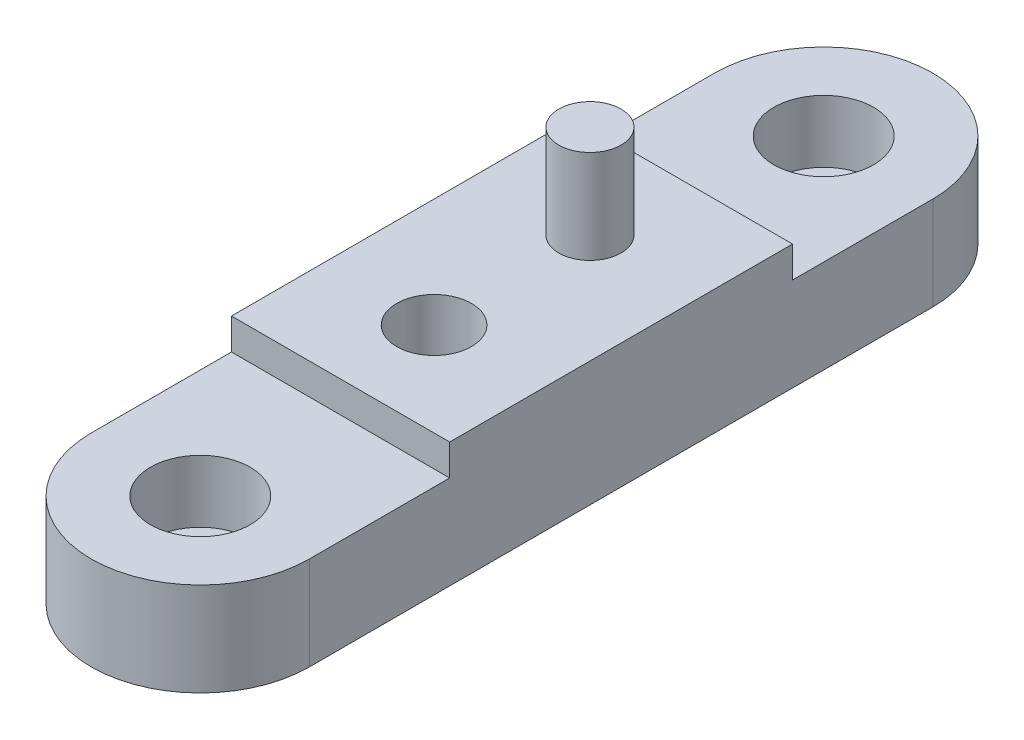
from build123d import *

# Parameters (mm, degrees)
BOSS_EXTRUDE1_DEPTH = 4
CUT_EXTRUDE1_START  = -1
CUT_EXTRUDE1_DEPTH  = 1
SKETCH3_R           = 1.6
CUT_EXTRUDE2_DEPTH  = 2
SKETCH4_R           = 1
BOSS_EXTRUDE2_DEPTH = 3
SKETCH5_R           = 1.2
CUT_EXTRUDE3_DEPTH  = 4


with BuildPart() as part:
    # Sketch1 → Boss-Extrude1 (new body)
    with BuildSketch(Plane(origin=(0, 0, 0), x_dir=(1, 0, 0), z_dir=(0, 1, 0))):
        with BuildLine():
            Line((-3.5, -10), (3.5, -10))
            Line((3.5, -10), (3.5, 0))
            ThreePointArc((3.5, 0), (0, 3.5), (-3.5, 0))
            Line((-3.5, 0), (-3.5, -10))
        make_face()
    extrude(amount=BOSS_EXTRUDE1_DEPTH)

    # Sketch2 → Cut-Extrude1 (cut)
    with BuildSketch(Plane(origin=(0, 4, 0), x_dir=(1, 0, 0), z_dir=(0, 1, 0)).offset(CUT_EXTRUDE1_START)):
        with BuildLine():
            Line((-3.5, -4.5), (3.5, -4.5))
            Line((3.5, -4.5), (3.5, 0))
            ThreePointArc((3.5, 0), (0, 3.5), (-3.5, 0))
            Line((-3.5, 0), (-3.5, -4.5))
        make_face()
    extrude(amount=CUT_EXTRUDE1_DEPTH, mode=Mode.SUBTRACT)

    # Sketch3 → Cut-Extrude2 (cut)
    with BuildSketch(Plane(origin=(0, 3, 0), x_dir=(1, 0, 0), z_dir=(0, 1, 0))):
        with Locations(Location((0, 0, 0), (0, 0, 270))):
            Circle(SKETCH3_R)
    extrude(amount=-CUT_EXTRUDE2_DEPTH, mode=Mode.SUBTRACT)

    # Mirror1: part across plane


with BuildPart() as part_1:
    add(part.part)
    add(part.part.mirror(Plane(origin=(-3.5, 4, 10), x_dir=(1, 0, 0), z_dir=(0, 0, -1))))

    # Sketch4 → Boss-Extrude2 (add)
    with BuildSketch(Plane(origin=(0, 4, 0), x_dir=(1, 0, 0), z_dir=(0, 1, 0))):
        with Locations(Location((0, -7.5, 0), (0, 0, 270))):
            Circle(SKETCH4_R)
    extrude(amount=BOSS_EXTRUDE2_DEPTH)

    # Sketch5 → Cut-Extrude3 (cut)
    with BuildSketch(Plane(origin=(0, 4, 0), x_dir=(1, 0, 0), z_dir=(0, 1, 0))):
        with Locations(Location((0, -12.5, 0), (0, 0, 270))):
            Circle(SKETCH5_R)
    extrude(amount=-CUT_EXTRUDE3_DEPTH, mode=Mode.SUBTRACT)


solid = part_1.part
